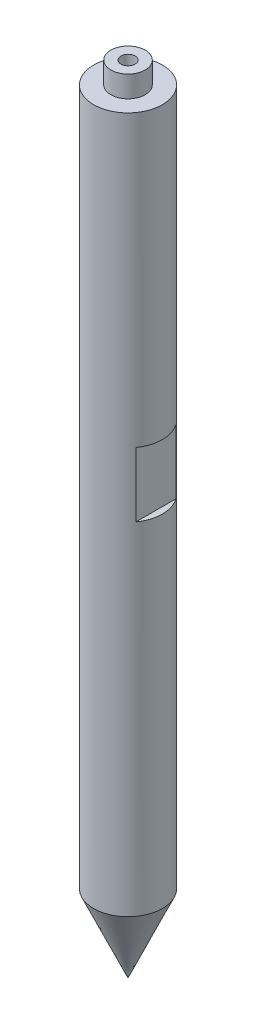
from build123d import *

# Parameters (mm, degrees)
SKETCH_10_R              = 4
EXTRUDE_1_DEPTH          = 5
CUT_EXTRUDE_1_DEPTH      = 181.355205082
CUT_EXTRUDE_1_DEPTH_BACK = 181.355205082
SKETCH_19_W              = 40
SKETCH_19_H              = 15
HOLE_WIZARD_M4_1_D       = 3.3
HOLE_WIZARD_M4_1_DEPTH   = 10.1
HOLE_WIZARD_M4_1_TIP     = 0.991420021


with BuildPart() as part:
    # Sketch 1 → Revolve 1 (revolve)
    with BuildSketch(Plane.XY, mode=Mode.PRIVATE) as revolve_1_sk:
        Polygon((0, 0), (-8, 0), (-8, -162), (0, -180), align=None)
    revolve(revolve_1_sk.sketch.rotate(Axis((0, -180, 0), (0, 1, 0)), 270), axis=Axis((0, -180, 0), (0, 1, 0)))

    # Sketch 10 → Extrude 1 (add)
    with BuildSketch(Plane(origin=(0, 0, 0), x_dir=(1, 0, 0), z_dir=(0, 1, 0))):
        with Locations(Location((0, 0, 0), (0, 0, 270))):
            Circle(SKETCH_10_R)
    extrude(amount=EXTRUDE_1_DEPTH)

    # Sketch 19 → Cut-Extrude 1 (cut, two sides: drawn at the far end of the back side and taken through both)
    with BuildSketch(Plane.XY.offset(-CUT_EXTRUDE_1_DEPTH_BACK)):
        with Locations((26.5, -75)):
            Rectangle(SKETCH_19_W, SKETCH_19_H)
        with Locations((-26.5, -75)):
            Rectangle(SKETCH_19_W, SKETCH_19_H)
    extrude(amount=CUT_EXTRUDE_1_DEPTH + CUT_EXTRUDE_1_DEPTH_BACK, mode=Mode.SUBTRACT)

    # Hole Wizard M4 _1
    with Locations(Plane(origin=(0, 5, 0), x_dir=(1, 0, 0), z_dir=(0, 1, 0))):
        with Locations((0, 0)):
            Hole(HOLE_WIZARD_M4_1_D / 2, depth=HOLE_WIZARD_M4_1_DEPTH)
            with Locations((0, 0, -(HOLE_WIZARD_M4_1_DEPTH + HOLE_WIZARD_M4_1_TIP / 2))):  # 118° drill point
                Cone(0, HOLE_WIZARD_M4_1_D / 2, HOLE_WIZARD_M4_1_TIP, mode=Mode.SUBTRACT)


solid = part.part
